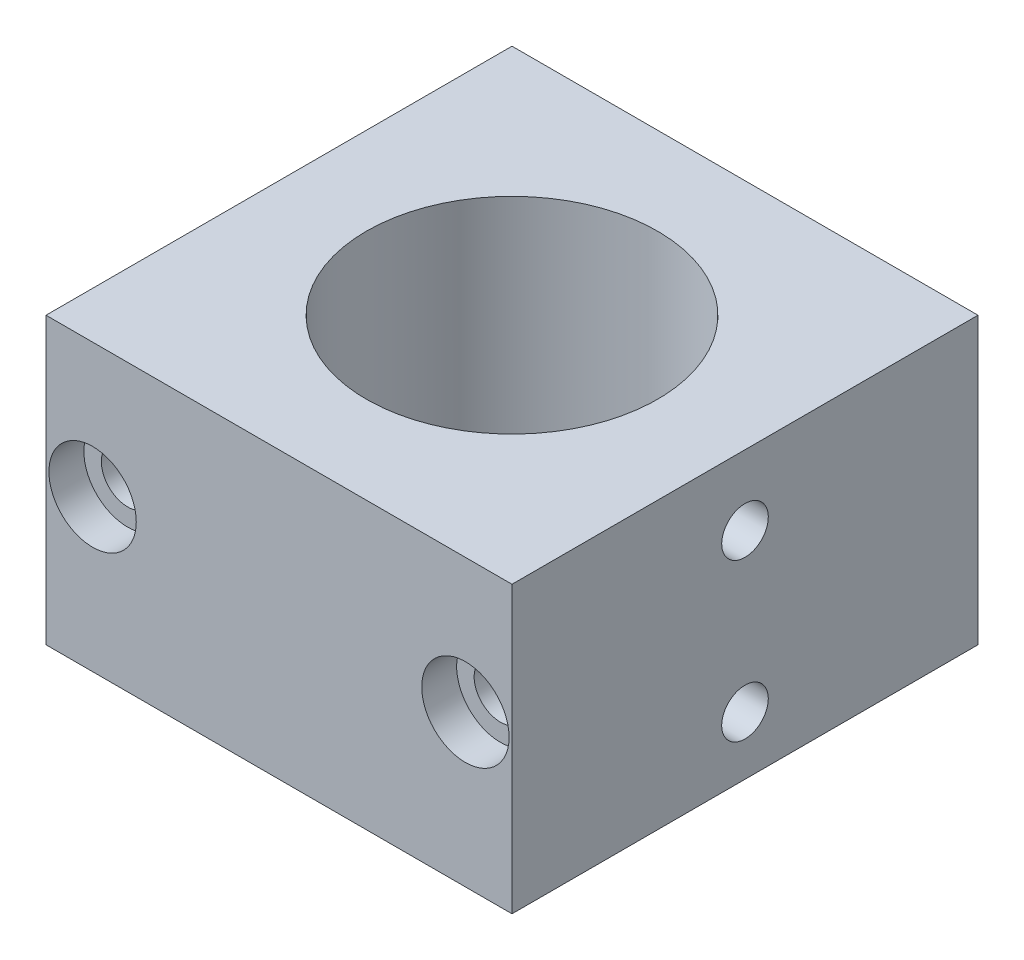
ISO-10303-21;
HEADER;
FILE_DESCRIPTION(('STEP AP214'),'2;1');
FILE_NAME('part.step','',(''),(''),'','','');
FILE_SCHEMA(('AUTOMOTIVE_DESIGN { 1 0 10303 214 1 1 1 1 }'));
ENDSEC;
DATA;
#1=APPLICATION_CONTEXT('core data for automotive mechanical design processes');
#2=APPLICATION_PROTOCOL_DEFINITION('international standard','automotive_design',2000,#1);
#3=PRODUCT_CONTEXT('',#1,'mechanical');
#4=PRODUCT('Part','Part','',(#3));
#5=PRODUCT_RELATED_PRODUCT_CATEGORY('part','',(#4));
#6=PRODUCT_DEFINITION_FORMATION('','',#4);
#7=PRODUCT_DEFINITION_CONTEXT('part definition',#1,'design');
#8=PRODUCT_DEFINITION('design','',#6,#7);
#9=PRODUCT_DEFINITION_SHAPE('','',#8);
#10=(LENGTH_UNIT() NAMED_UNIT(*) SI_UNIT(.MILLI.,.METRE.));
#11=(NAMED_UNIT(*) PLANE_ANGLE_UNIT() SI_UNIT($,.RADIAN.));
#12=(NAMED_UNIT(*) SI_UNIT($,.STERADIAN.) SOLID_ANGLE_UNIT());
#13=UNCERTAINTY_MEASURE_WITH_UNIT(LENGTH_MEASURE(1.E-05),#10,'distance_accuracy_value','');
#14=(GEOMETRIC_REPRESENTATION_CONTEXT(3) GLOBAL_UNCERTAINTY_ASSIGNED_CONTEXT((#13)) GLOBAL_UNIT_ASSIGNED_CONTEXT((#10,
#11,#12)) REPRESENTATION_CONTEXT('',''));
#15=CARTESIAN_POINT('',(0.,0.,0.));
#16=DIRECTION('',(0.,0.,1.));
#17=DIRECTION('',(1.,0.,0.));
#18=AXIS2_PLACEMENT_3D('',#15,#16,#17);
#19=CARTESIAN_POINT('',(20.,4.99999999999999,20.));
#20=DIRECTION('',(0.,1.,0.));
#21=DIRECTION('',(-1.,0.,0.));
#22=AXIS2_PLACEMENT_3D('',#19,#20,#21);
#23=CYLINDRICAL_SURFACE('',#22,12.5);
#24=CARTESIAN_POINT('',(32.4899959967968,4.99999999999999,20.5));
#25=CARTESIAN_POINT('',(32.4899923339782,5.02811655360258,20.500023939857));
#26=CARTESIAN_POINT('',(32.4900908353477,5.05622572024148,20.4976298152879));
#27=CARTESIAN_POINT('',(32.4904650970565,5.1116275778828,20.488182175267));
#28=CARTESIAN_POINT('',(32.4907407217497,5.13892087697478,20.481132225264));
#29=CARTESIAN_POINT('',(32.4914423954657,5.19194663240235,20.4625449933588));
#30=CARTESIAN_POINT('',(32.4918685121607,5.21767838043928,20.4510056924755));
#31=CARTESIAN_POINT('',(32.4928218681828,5.26683517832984,20.423778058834));
#32=CARTESIAN_POINT('',(32.49334908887,5.29026065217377,20.408090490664));
#33=CARTESIAN_POINT('',(32.4944459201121,5.33415860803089,20.3729988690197));
#34=CARTESIAN_POINT('',(32.4950155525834,5.35462954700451,20.3535928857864));
#35=CARTESIAN_POINT('',(32.496132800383,5.39202700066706,20.3116168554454));
#36=CARTESIAN_POINT('',(32.4966804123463,5.40895297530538,20.2890463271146));
#37=CARTESIAN_POINT('',(32.4976920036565,5.43878075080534,20.2413757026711));
#38=CARTESIAN_POINT('',(32.4981559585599,5.45168137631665,20.2162748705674));
#39=CARTESIAN_POINT('',(32.4989476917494,5.4730839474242,20.1642630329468));
#40=CARTESIAN_POINT('',(32.4992754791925,5.48158618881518,20.1373521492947));
#41=CARTESIAN_POINT('',(32.4997578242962,5.49394756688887,20.0824975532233));
#42=CARTESIAN_POINT('',(32.4999124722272,5.49780912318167,20.0545543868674));
#43=CARTESIAN_POINT('',(32.5000314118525,5.50078699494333,19.9984153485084));
#44=CARTESIAN_POINT('',(32.4999956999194,5.49990321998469,19.9702194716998));
#45=CARTESIAN_POINT('',(32.4997380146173,5.49341737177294,19.9143933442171));
#46=CARTESIAN_POINT('',(32.4995161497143,5.48781804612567,19.8867627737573));
#47=CARTESIAN_POINT('',(32.498911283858,5.47206431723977,19.8328342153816));
#48=CARTESIAN_POINT('',(32.4985282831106,5.46190991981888,19.8065362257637));
#49=CARTESIAN_POINT('',(32.4976441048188,5.43733089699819,19.7560098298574));
#50=CARTESIAN_POINT('',(32.4971428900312,5.42290492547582,19.7317820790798));
#51=CARTESIAN_POINT('',(32.4960787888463,5.39019401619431,19.6860924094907));
#52=CARTESIAN_POINT('',(32.4955159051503,5.37190924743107,19.6646303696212));
#53=CARTESIAN_POINT('',(32.4943914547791,5.33198695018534,19.6250667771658));
#54=CARTESIAN_POINT('',(32.4938298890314,5.3103475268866,19.6069671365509));
#55=CARTESIAN_POINT('',(32.4927715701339,5.26432844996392,19.5746518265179));
#56=CARTESIAN_POINT('',(32.492274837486,5.23994793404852,19.5604373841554));
#57=CARTESIAN_POINT('',(32.4914019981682,5.18913041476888,19.5362953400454));
#58=CARTESIAN_POINT('',(32.4910259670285,5.16269213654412,19.52637042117));
#59=CARTESIAN_POINT('',(32.4904386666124,5.10855544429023,19.5111199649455));
#60=CARTESIAN_POINT('',(32.4902271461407,5.08085902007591,19.5057874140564));
#61=CARTESIAN_POINT('',(32.4900332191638,5.03534351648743,19.500934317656));
#62=CARTESIAN_POINT('',(32.4899949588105,5.01766715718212,19.4999923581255));
#63=CARTESIAN_POINT('',(32.4899959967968,4.99999999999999,19.5));
#64=B_SPLINE_CURVE_WITH_KNOTS('',3,(#24,#25,#26,#27,#28,#29,#30,#31,#32,#33,#34,#35,#36,#37,#38,
#39,#40,#41,#42,#43,#44,#45,#46,#47,#48,#49,#50,#51,#52,#53,#54,#55,#56,#57,#58,#59,#60,#61,#62,
#63),.UNSPECIFIED.,.F.,.F.,(4,2,2,2,2,2,2,2,2,2,2,2,2,2,2,2,2,2,2,4),(0.,0.0842371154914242,
0.168409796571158,0.252620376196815,0.336815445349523,0.421054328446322,0.505306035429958,
0.589582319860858,0.673852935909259,0.758079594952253,0.842307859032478,0.926487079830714,
1.0106661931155,1.09487186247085,1.17907384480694,1.26332356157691,1.34759985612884,
1.43192878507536,1.51612869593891,1.56912952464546),.UNSPECIFIED.);
#65=CARTESIAN_POINT('',(32.4899959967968,4.99999999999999,20.5));
#66=VERTEX_POINT('',#65);
#67=CARTESIAN_POINT('',(32.4899959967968,4.99999999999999,19.5));
#68=VERTEX_POINT('',#67);
#69=EDGE_CURVE('E187',#66,#68,#64,.T.);
#70=ORIENTED_EDGE('',*,*,#69,.F.);
#71=CARTESIAN_POINT('',(20.,4.99999999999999,20.));
#72=DIRECTION('',(0.,1.,0.));
#73=DIRECTION('',(-1.,0.,0.));
#74=AXIS2_PLACEMENT_3D('',#71,#72,#73);
#75=CIRCLE('',#74,12.5);
#76=EDGE_CURVE('E155',#68,#66,#75,.T.);
#77=ORIENTED_EDGE('',*,*,#76,.F.);
#78=EDGE_LOOP('',(#70,#77));
#79=FACE_BOUND('',#78,.T.);
#80=CARTESIAN_POINT('',(20.,24.5,20.));
#81=DIRECTION('',(0.,1.,0.));
#82=DIRECTION('',(-1.,0.,0.));
#83=AXIS2_PLACEMENT_3D('',#80,#81,#82);
#84=CIRCLE('',#83,12.5);
#85=CARTESIAN_POINT('',(7.5,24.5,20.));
#86=VERTEX_POINT('',#85);
#87=EDGE_CURVE('E157',#86,#86,#84,.T.);
#88=ORIENTED_EDGE('',*,*,#87,.T.);
#89=EDGE_LOOP('',(#88));
#90=FACE_BOUND('',#89,.T.);
#91=CARTESIAN_POINT('',(32.4899959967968,17.,19.5));
#92=CARTESIAN_POINT('',(32.4899961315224,16.9719268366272,19.5000012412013));
#93=CARTESIAN_POINT('',(32.4900916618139,16.9438336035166,19.5023722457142));
#94=CARTESIAN_POINT('',(32.4904635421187,16.8884216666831,19.5117972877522));
#95=CARTESIAN_POINT('',(32.4907401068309,16.8611039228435,19.5188568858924));
#96=CARTESIAN_POINT('',(32.4914426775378,16.8080537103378,19.5374570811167));
#97=CARTESIAN_POINT('',(32.4918686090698,16.7823204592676,19.5489954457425));
#98=CARTESIAN_POINT('',(32.4928218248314,16.7331632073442,19.57622233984));
#99=CARTESIAN_POINT('',(32.4933490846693,16.7097386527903,19.5919098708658));
#100=CARTESIAN_POINT('',(32.4944459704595,16.6658402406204,19.6270022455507));
#101=CARTESIAN_POINT('',(32.4950156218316,16.6453681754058,19.6464093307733));
#102=CARTESIAN_POINT('',(32.4961328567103,16.6079710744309,19.6883856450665));
#103=CARTESIAN_POINT('',(32.4966804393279,16.5910461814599,19.7109550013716));
#104=CARTESIAN_POINT('',(32.4976919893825,16.56121971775,19.7586235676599));
#105=CARTESIAN_POINT('',(32.4981559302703,16.5483194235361,19.783723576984));
#106=CARTESIAN_POINT('',(32.4989476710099,16.5269165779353,19.8357352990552));
#107=CARTESIAN_POINT('',(32.4992754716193,16.5184140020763,19.8626470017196));
#108=CARTESIAN_POINT('',(32.4997578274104,16.5060523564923,19.9175027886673));
#109=CARTESIAN_POINT('',(32.4999124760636,16.5021907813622,19.9454463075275));
#110=CARTESIAN_POINT('',(32.5000314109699,16.4992130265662,20.0015853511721));
#111=CARTESIAN_POINT('',(32.4999956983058,16.5000968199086,20.0297808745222));
#112=CARTESIAN_POINT('',(32.4997380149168,16.5065826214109,20.0856065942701));
#113=CARTESIAN_POINT('',(32.4995161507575,16.5121819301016,20.1132371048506));
#114=CARTESIAN_POINT('',(32.4989112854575,16.5279356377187,20.1671656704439));
#115=CARTESIAN_POINT('',(32.4985282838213,16.5380900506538,20.1934637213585));
#116=CARTESIAN_POINT('',(32.4976441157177,16.562668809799,20.243989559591));
#117=CARTESIAN_POINT('',(32.4971429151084,16.5770943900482,20.2682167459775));
#118=CARTESIAN_POINT('',(32.4960788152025,16.6098050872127,20.3139065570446));
#119=CARTESIAN_POINT('',(32.4955159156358,16.6280902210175,20.3353691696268));
#120=CARTESIAN_POINT('',(32.494391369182,16.6680162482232,20.3749363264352));
#121=CARTESIAN_POINT('',(32.4938297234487,16.6896594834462,20.3930385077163));
#122=CARTESIAN_POINT('',(32.492771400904,16.7356790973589,20.4253527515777));
#123=CARTESIAN_POINT('',(32.4922747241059,16.7600554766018,20.4395648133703));
#124=CARTESIAN_POINT('',(32.4914023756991,16.810850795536,20.4636951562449));
#125=CARTESIAN_POINT('',(32.491026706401,16.8372697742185,20.4736133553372));
#126=CARTESIAN_POINT('',(32.490438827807,16.8913997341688,20.4888728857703));
#127=CARTESIAN_POINT('',(32.4902266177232,16.9191107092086,20.4942142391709));
#128=CARTESIAN_POINT('',(32.4899897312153,16.975017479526,20.5001655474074));
#129=CARTESIAN_POINT('',(32.4899649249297,17.0032129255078,20.5007787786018));
#130=CARTESIAN_POINT('',(32.490105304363,17.0593063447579,20.4972649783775));
#131=CARTESIAN_POINT('',(32.4902704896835,17.08720431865,20.493137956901));
#132=CARTESIAN_POINT('',(32.4907721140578,17.141901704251,20.4802635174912));
#133=CARTESIAN_POINT('',(32.4911084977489,17.1687014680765,20.4715175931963));
#134=CARTESIAN_POINT('',(32.4919145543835,17.2204525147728,20.4496551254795));
#135=CARTESIAN_POINT('',(32.4923842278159,17.2454037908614,20.4365385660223));
#136=CARTESIAN_POINT('',(32.4934042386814,17.2927646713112,20.4062987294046));
#137=CARTESIAN_POINT('',(32.4939546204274,17.3151728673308,20.3891732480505));
#138=CARTESIAN_POINT('',(32.4950738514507,17.3567973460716,20.3514049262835));
#139=CARTESIAN_POINT('',(32.4956427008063,17.3760136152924,20.3307620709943));
#140=CARTESIAN_POINT('',(32.4967351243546,17.4107197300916,20.2865309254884));
#141=CARTESIAN_POINT('',(32.4972586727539,17.4262074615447,20.2629409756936));
#142=CARTESIAN_POINT('',(32.4982011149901,17.4530024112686,20.2134936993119));
#143=CARTESIAN_POINT('',(32.4986200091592,17.4643096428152,20.1876363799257));
#144=CARTESIAN_POINT('',(32.4993058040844,17.4824189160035,20.1343962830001));
#145=CARTESIAN_POINT('',(32.4995727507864,17.4892223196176,20.1070139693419));
#146=CARTESIAN_POINT('',(32.4999247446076,17.498135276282,20.051494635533));
#147=CARTESIAN_POINT('',(32.5000097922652,17.5002448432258,20.0233576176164));
#148=CARTESIAN_POINT('',(32.4999884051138,17.4997100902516,19.9671486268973));
#149=CARTESIAN_POINT('',(32.4998821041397,17.4970690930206,19.939076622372));
#150=CARTESIAN_POINT('',(32.4994902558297,17.4871150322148,19.8837748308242));
#151=CARTESIAN_POINT('',(32.4992047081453,17.4798019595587,19.8565450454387));
#152=CARTESIAN_POINT('',(32.4984865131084,17.4607119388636,19.8036997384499));
#153=CARTESIAN_POINT('',(32.4980538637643,17.4489349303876,19.7780842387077));
#154=CARTESIAN_POINT('',(32.4970901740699,17.421252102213,19.7291942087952));
#155=CARTESIAN_POINT('',(32.496559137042,17.405346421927,19.7059195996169));
#156=CARTESIAN_POINT('',(32.4954580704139,17.3698465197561,19.66235585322));
#157=CARTESIAN_POINT('',(32.4948880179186,17.3502501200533,19.6420684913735));
#158=CARTESIAN_POINT('',(32.4937732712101,17.3079238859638,19.6050656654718));
#159=CARTESIAN_POINT('',(32.4932285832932,17.2851932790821,19.588351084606));
#160=CARTESIAN_POINT('',(32.4922257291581,17.2372310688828,19.558963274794));
#161=CARTESIAN_POINT('',(32.4917676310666,17.21199751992,19.5462932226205));
#162=CARTESIAN_POINT('',(32.4909907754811,17.1597787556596,19.525384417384));
#163=CARTESIAN_POINT('',(32.4906718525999,17.132795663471,19.5171404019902));
#164=CARTESIAN_POINT('',(32.4902942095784,17.0880361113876,19.5074926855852));
#165=CARTESIAN_POINT('',(32.4901828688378,17.0705499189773,19.504686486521));
#166=CARTESIAN_POINT('',(32.490033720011,17.0353784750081,19.5009397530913));
#167=CARTESIAN_POINT('',(32.4899959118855,17.0176932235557,19.4999992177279));
#168=CARTESIAN_POINT('',(32.4899959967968,17.,19.5));
#169=B_SPLINE_CURVE_WITH_KNOTS('',3,(#91,#92,#93,#94,#95,#96,#97,#98,#99,#100,#101,#102,#103,
#104,#105,#106,#107,#108,#109,#110,#111,#112,#113,#114,#115,#116,#117,#118,#119,#120,#121,#122,
#123,#124,#125,#126,#127,#128,#129,#130,#131,#132,#133,#134,#135,#136,#137,#138,#139,#140,#141,
#142,#143,#144,#145,#146,#147,#148,#149,#150,#151,#152,#153,#154,#155,#156,#157,#158,#159,#160,
#161,#162,#163,#164,#165,#166,#167,#168),.UNSPECIFIED.,.T.,.F.,(4,2,2,2,2,2,2,2,2,2,2,2,2,2,2,2,
2,2,2,2,2,2,2,2,2,2,2,2,2,2,2,2,2,2,2,2,2,2,4),(0.,0.0841549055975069,0.168409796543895,
0.252622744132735,0.336815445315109,0.421059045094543,0.505306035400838,0.589579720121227,
0.673852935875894,0.758080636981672,0.842307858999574,0.926486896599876,1.01066619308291,
1.09486983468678,1.17907384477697,1.26333684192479,1.34759985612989,1.43186447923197,
1.51612869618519,1.60033451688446,1.68454016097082,1.76871859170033,1.85289733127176,
1.93712246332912,2.02134795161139,2.10562108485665,2.18989395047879,2.27414132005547,
2.35838844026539,2.44257665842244,2.52676504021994,2.6109545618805,2.69514124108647,
2.77937775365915,2.86363506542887,2.94795839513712,3.03218124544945,3.08522023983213,
3.13825920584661),.UNSPECIFIED.);
#170=CARTESIAN_POINT('',(32.4899959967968,17.,19.5));
#171=VERTEX_POINT('',#170);
#172=EDGE_CURVE('E270',#171,#171,#169,.T.);
#173=ORIENTED_EDGE('',*,*,#172,.F.);
#174=EDGE_LOOP('',(#173));
#175=FACE_BOUND('',#174,.T.);
#176=ADVANCED_FACE('F37',(#79,#90,#175),#23,.F.);
#177=CARTESIAN_POINT('',(34.,18.5,20.));
#178=DIRECTION('',(1.,0.,0.));
#179=DIRECTION('',(0.,0.,-1.));
#180=AXIS2_PLACEMENT_3D('',#177,#178,#179);
#181=PLANE('',#180);
#182=CARTESIAN_POINT('',(34.,18.5,20.));
#183=DIRECTION('',(1.,0.,0.));
#184=DIRECTION('',(0.,0.,-1.));
#185=AXIS2_PLACEMENT_3D('',#182,#183,#184);
#186=CIRCLE('',#185,2.00000000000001);
#187=CARTESIAN_POINT('',(34.,16.5,20.));
#188=VERTEX_POINT('',#187);
#189=EDGE_CURVE('E272',#188,#188,#186,.T.);
#190=ORIENTED_EDGE('',*,*,#189,.T.);
#191=CARTESIAN_POINT('',(34.,17.,20.));
#192=DIRECTION('',(1.,0.,0.));
#193=DIRECTION('',(0.,0.,-1.));
#194=AXIS2_PLACEMENT_3D('',#191,#192,#193);
#195=CIRCLE('',#194,0.5);
#196=EDGE_CURVE('E41',#188,#188,#195,.F.);
#197=ORIENTED_EDGE('',*,*,#196,.T.);
#198=EDGE_LOOP('',(#190,#197));
#199=FACE_BOUND('',#198,.T.);
#200=ADVANCED_FACE('F254',(#199),#181,.T.);
#201=CARTESIAN_POINT('',(40.,24.5,40.));
#202=DIRECTION('',(1.,0.,0.));
#203=DIRECTION('',(0.,0.,-1.));
#204=AXIS2_PLACEMENT_3D('',#201,#202,#203);
#205=PLANE('',#204);
#206=CARTESIAN_POINT('',(40.,5.,20.));
#207=DIRECTION('',(1.,0.,0.));
#208=DIRECTION('',(0.,0.,-1.));
#209=AXIS2_PLACEMENT_3D('',#206,#207,#208);
#210=CIRCLE('',#209,2.00000000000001);
#211=CARTESIAN_POINT('',(40.,5.,18.));
#212=VERTEX_POINT('',#211);
#213=EDGE_CURVE('E180',#212,#212,#210,.T.);
#214=ORIENTED_EDGE('',*,*,#213,.F.);
#215=EDGE_LOOP('',(#214));
#216=FACE_BOUND('',#215,.T.);
#217=DIRECTION('',(0.,-1.,0.));
#218=VECTOR('',#217,1.);
#219=CARTESIAN_POINT('',(40.,24.5,0.));
#220=LINE('',#219,#218);
#221=CARTESIAN_POINT('',(40.,24.5,0.));
#222=VERTEX_POINT('',#221);
#223=CARTESIAN_POINT('',(40.,0.,0.));
#224=VERTEX_POINT('',#223);
#225=EDGE_CURVE('E146',#222,#224,#220,.T.);
#226=ORIENTED_EDGE('',*,*,#225,.F.);
#227=DIRECTION('',(0.,0.,-1.));
#228=VECTOR('',#227,1.);
#229=CARTESIAN_POINT('',(40.,24.5,40.));
#230=LINE('',#229,#228);
#231=CARTESIAN_POINT('',(40.,24.5,40.));
#232=VERTEX_POINT('',#231);
#233=EDGE_CURVE('E128',#232,#222,#230,.T.);
#234=ORIENTED_EDGE('',*,*,#233,.F.);
#235=DIRECTION('',(0.,-1.,0.));
#236=VECTOR('',#235,1.);
#237=CARTESIAN_POINT('',(40.,24.5,40.));
#238=LINE('',#237,#236);
#239=CARTESIAN_POINT('',(40.,0.,40.));
#240=VERTEX_POINT('',#239);
#241=EDGE_CURVE('E135',#232,#240,#238,.T.);
#242=ORIENTED_EDGE('',*,*,#241,.T.);
#243=DIRECTION('',(0.,0.,-1.));
#244=VECTOR('',#243,1.);
#245=CARTESIAN_POINT('',(40.,0.,40.));
#246=LINE('',#245,#244);
#247=EDGE_CURVE('E131',#240,#224,#246,.T.);
#248=ORIENTED_EDGE('',*,*,#247,.T.);
#249=EDGE_LOOP('',(#226,#234,#242,#248));
#250=FACE_BOUND('',#249,.T.);
#251=CARTESIAN_POINT('',(40.,18.5,20.));
#252=DIRECTION('',(1.,0.,0.));
#253=DIRECTION('',(0.,0.,-1.));
#254=AXIS2_PLACEMENT_3D('',#251,#252,#253);
#255=CIRCLE('',#254,2.00000000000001);
#256=CARTESIAN_POINT('',(40.,16.5,20.));
#257=VERTEX_POINT('',#256);
#258=EDGE_CURVE('E275',#257,#257,#255,.T.);
#259=ORIENTED_EDGE('',*,*,#258,.F.);
#260=EDGE_LOOP('',(#259));
#261=FACE_BOUND('',#260,.T.);
#262=ADVANCED_FACE('F250',(#216,#250,#261),#205,.T.);
#263=CARTESIAN_POINT('',(20.,4.99999999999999,20.));
#264=DIRECTION('',(0.,1.,0.));
#265=DIRECTION('',(-1.,0.,0.));
#266=AXIS2_PLACEMENT_3D('',#263,#264,#265);
#267=PLANE('',#266);
#268=ORIENTED_EDGE('',*,*,#76,.T.);
#269=DIRECTION('',(1.,0.,0.));
#270=VECTOR('',#269,1.);
#271=CARTESIAN_POINT('',(40.,5.,20.5));
#272=LINE('',#271,#270);
#273=CARTESIAN_POINT('',(31.,5.,20.5));
#274=VERTEX_POINT('',#273);
#275=EDGE_CURVE('E110',#66,#274,#272,.F.);
#276=ORIENTED_EDGE('',*,*,#275,.T.);
#277=DIRECTION('',(0.515038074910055,0.,0.857167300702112));
#278=VECTOR('',#277,1.);
#279=CARTESIAN_POINT('',(30.6995696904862,5.,20.));
#280=LINE('',#279,#278);
#281=CARTESIAN_POINT('',(30.6995696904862,5.,20.));
#282=VERTEX_POINT('',#281);
#283=EDGE_CURVE('E100',#274,#282,#280,.F.);
#284=ORIENTED_EDGE('',*,*,#283,.T.);
#285=DIRECTION('',(-0.515038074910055,0.,0.857167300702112));
#286=VECTOR('',#285,1.);
#287=CARTESIAN_POINT('',(30.6995696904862,5.,20.));
#288=LINE('',#287,#286);
#289=CARTESIAN_POINT('',(31.,5.,19.5));
#290=VERTEX_POINT('',#289);
#291=EDGE_CURVE('E97',#282,#290,#288,.F.);
#292=ORIENTED_EDGE('',*,*,#291,.T.);
#293=DIRECTION('',(1.,0.,0.));
#294=VECTOR('',#293,1.);
#295=CARTESIAN_POINT('',(40.,5.,19.5));
#296=LINE('',#295,#294);
#297=EDGE_CURVE('E115',#290,#68,#296,.T.);
#298=ORIENTED_EDGE('',*,*,#297,.T.);
#299=EDGE_LOOP('',(#268,#276,#284,#292,#298));
#300=FACE_BOUND('',#299,.T.);
#301=ADVANCED_FACE('F109',(#300),#267,.T.);
#302=CARTESIAN_POINT('',(34.,5.00000000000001,20.));
#303=DIRECTION('',(1.,0.,0.));
#304=DIRECTION('',(0.,0.,-1.));
#305=AXIS2_PLACEMENT_3D('',#302,#303,#304);
#306=PLANE('',#305);
#307=CARTESIAN_POINT('',(34.,5.,20.));
#308=DIRECTION('',(1.,0.,0.));
#309=DIRECTION('',(0.,0.,-1.));
#310=AXIS2_PLACEMENT_3D('',#307,#308,#309);
#311=CIRCLE('',#310,2.00000000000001);
#312=CARTESIAN_POINT('',(34.,5.,18.));
#313=VERTEX_POINT('',#312);
#314=EDGE_CURVE('E183',#313,#313,#311,.T.);
#315=ORIENTED_EDGE('',*,*,#314,.T.);
#316=EDGE_LOOP('',(#315));
#317=FACE_BOUND('',#316,.T.);
#318=CARTESIAN_POINT('',(34.,5.,20.));
#319=DIRECTION('',(1.,0.,0.));
#320=DIRECTION('',(0.,0.,-1.));
#321=AXIS2_PLACEMENT_3D('',#318,#319,#320);
#322=CIRCLE('',#321,0.5);
#323=CARTESIAN_POINT('',(34.,5.,19.5));
#324=VERTEX_POINT('',#323);
#325=EDGE_CURVE('E112',#324,#324,#322,.F.);
#326=ORIENTED_EDGE('',*,*,#325,.T.);
#327=EDGE_LOOP('',(#326));
#328=FACE_BOUND('',#327,.T.);
#329=ADVANCED_FACE('F209',(#317,#328),#306,.T.);
#330=CARTESIAN_POINT('',(0.,0.,40.));
#331=DIRECTION('',(0.,0.,-1.));
#332=DIRECTION('',(-1.,0.,0.));
#333=AXIS2_PLACEMENT_3D('',#330,#331,#332);
#334=PLANE('',#333);
#335=CARTESIAN_POINT('',(4.,13.,40.));
#336=DIRECTION('',(0.,0.,1.));
#337=DIRECTION('',(1.,0.,0.));
#338=AXIS2_PLACEMENT_3D('',#335,#336,#337);
#339=CIRCLE('',#338,3.75000000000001);
#340=CARTESIAN_POINT('',(7.75000000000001,13.,40.));
#341=VERTEX_POINT('',#340);
#342=EDGE_CURVE('E119',#341,#341,#339,.T.);
#343=ORIENTED_EDGE('',*,*,#342,.F.);
#344=EDGE_LOOP('',(#343));
#345=FACE_BOUND('',#344,.T.);
#346=DIRECTION('',(0.,1.,0.));
#347=VECTOR('',#346,1.);
#348=CARTESIAN_POINT('',(0.,0.,40.));
#349=LINE('',#348,#347);
#350=CARTESIAN_POINT('',(0.,0.,40.));
#351=VERTEX_POINT('',#350);
#352=CARTESIAN_POINT('',(0.,24.5,40.));
#353=VERTEX_POINT('',#352);
#354=EDGE_CURVE('E140',#351,#353,#349,.T.);
#355=ORIENTED_EDGE('',*,*,#354,.F.);
#356=DIRECTION('',(1.,0.,0.));
#357=VECTOR('',#356,1.);
#358=CARTESIAN_POINT('',(0.,0.,40.));
#359=LINE('',#358,#357);
#360=EDGE_CURVE('E129',#351,#240,#359,.T.);
#361=ORIENTED_EDGE('',*,*,#360,.T.);
#362=ORIENTED_EDGE('',*,*,#241,.F.);
#363=DIRECTION('',(-1.,0.,0.));
#364=VECTOR('',#363,1.);
#365=CARTESIAN_POINT('',(40.,24.5,40.));
#366=LINE('',#365,#364);
#367=EDGE_CURVE('E138',#232,#353,#366,.T.);
#368=ORIENTED_EDGE('',*,*,#367,.T.);
#369=EDGE_LOOP('',(#355,#361,#362,#368));
#370=FACE_BOUND('',#369,.T.);
#371=CARTESIAN_POINT('',(36.,13.,40.));
#372=DIRECTION('',(0.,0.,1.));
#373=DIRECTION('',(1.,0.,0.));
#374=AXIS2_PLACEMENT_3D('',#371,#372,#373);
#375=CIRCLE('',#374,3.75000000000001);
#376=CARTESIAN_POINT('',(39.75,13.,40.));
#377=VERTEX_POINT('',#376);
#378=EDGE_CURVE('E177',#377,#377,#375,.T.);
#379=ORIENTED_EDGE('',*,*,#378,.F.);
#380=EDGE_LOOP('',(#379));
#381=FACE_BOUND('',#380,.T.);
#382=ADVANCED_FACE('F212',(#345,#370,#381),#334,.F.);
#383=CARTESIAN_POINT('',(0.,0.,0.));
#384=DIRECTION('',(0.,0.,-1.));
#385=DIRECTION('',(-1.,0.,0.));
#386=AXIS2_PLACEMENT_3D('',#383,#384,#385);
#387=PLANE('',#386);
#388=CARTESIAN_POINT('',(4.,13.,0.));
#389=DIRECTION('',(0.,0.,-1.));
#390=DIRECTION('',(-1.,0.,0.));
#391=AXIS2_PLACEMENT_3D('',#388,#389,#390);
#392=CIRCLE('',#391,2.25000000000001);
#393=CARTESIAN_POINT('',(1.74999999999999,13.,0.));
#394=VERTEX_POINT('',#393);
#395=EDGE_CURVE('E121',#394,#394,#392,.F.);
#396=ORIENTED_EDGE('',*,*,#395,.T.);
#397=EDGE_LOOP('',(#396));
#398=FACE_BOUND('',#397,.T.);
#399=DIRECTION('',(0.,1.,0.));
#400=VECTOR('',#399,1.);
#401=CARTESIAN_POINT('',(0.,0.,0.));
#402=LINE('',#401,#400);
#403=CARTESIAN_POINT('',(0.,0.,0.));
#404=VERTEX_POINT('',#403);
#405=CARTESIAN_POINT('',(0.,24.5,0.));
#406=VERTEX_POINT('',#405);
#407=EDGE_CURVE('E152',#404,#406,#402,.T.);
#408=ORIENTED_EDGE('',*,*,#407,.T.);
#409=DIRECTION('',(-1.,0.,0.));
#410=VECTOR('',#409,1.);
#411=CARTESIAN_POINT('',(40.,24.5,0.));
#412=LINE('',#411,#410);
#413=EDGE_CURVE('E149',#222,#406,#412,.T.);
#414=ORIENTED_EDGE('',*,*,#413,.F.);
#415=ORIENTED_EDGE('',*,*,#225,.T.);
#416=DIRECTION('',(1.,0.,0.));
#417=VECTOR('',#416,1.);
#418=CARTESIAN_POINT('',(0.,0.,0.));
#419=LINE('',#418,#417);
#420=EDGE_CURVE('E143',#404,#224,#419,.T.);
#421=ORIENTED_EDGE('',*,*,#420,.F.);
#422=EDGE_LOOP('',(#408,#414,#415,#421));
#423=FACE_BOUND('',#422,.T.);
#424=CARTESIAN_POINT('',(36.,13.,0.));
#425=DIRECTION('',(0.,0.,-1.));
#426=DIRECTION('',(-1.,0.,0.));
#427=AXIS2_PLACEMENT_3D('',#424,#425,#426);
#428=CIRCLE('',#427,2.25000000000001);
#429=CARTESIAN_POINT('',(33.75,13.,0.));
#430=VERTEX_POINT('',#429);
#431=EDGE_CURVE('E116',#430,#430,#428,.F.);
#432=ORIENTED_EDGE('',*,*,#431,.T.);
#433=EDGE_LOOP('',(#432));
#434=FACE_BOUND('',#433,.T.);
#435=ADVANCED_FACE('F356',(#398,#423,#434),#387,.T.);
#436=CARTESIAN_POINT('',(0.,0.,40.));
#437=DIRECTION('',(-1.,0.,0.));
#438=DIRECTION('',(0.,0.,1.));
#439=AXIS2_PLACEMENT_3D('',#436,#437,#438);
#440=PLANE('',#439);
#441=ORIENTED_EDGE('',*,*,#407,.F.);
#442=DIRECTION('',(0.,0.,-1.));
#443=VECTOR('',#442,1.);
#444=CARTESIAN_POINT('',(0.,0.,40.));
#445=LINE('',#444,#443);
#446=EDGE_CURVE('E105',#351,#404,#445,.T.);
#447=ORIENTED_EDGE('',*,*,#446,.F.);
#448=ORIENTED_EDGE('',*,*,#354,.T.);
#449=DIRECTION('',(0.,0.,-1.));
#450=VECTOR('',#449,1.);
#451=CARTESIAN_POINT('',(0.,24.5,40.));
#452=LINE('',#451,#450);
#453=EDGE_CURVE('E126',#353,#406,#452,.T.);
#454=ORIENTED_EDGE('',*,*,#453,.T.);
#455=EDGE_LOOP('',(#441,#447,#448,#454));
#456=FACE_BOUND('',#455,.T.);
#457=ADVANCED_FACE('F39',(#456),#440,.T.);
#458=CARTESIAN_POINT('',(0.,0.,40.));
#459=DIRECTION('',(0.,1.,0.));
#460=DIRECTION('',(0.,0.,1.));
#461=AXIS2_PLACEMENT_3D('',#458,#459,#460);
#462=PLANE('',#461);
#463=CARTESIAN_POINT('',(20.,0.,20.));
#464=DIRECTION('',(0.,-1.,0.));
#465=DIRECTION('',(0.,0.,-1.));
#466=AXIS2_PLACEMENT_3D('',#463,#464,#465);
#467=CIRCLE('',#466,10.);
#468=CARTESIAN_POINT('',(20.,0.,9.99999999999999));
#469=VERTEX_POINT('',#468);
#470=EDGE_CURVE('E124',#469,#469,#467,.T.);
#471=ORIENTED_EDGE('',*,*,#470,.F.);
#472=EDGE_LOOP('',(#471));
#473=FACE_BOUND('',#472,.T.);
#474=ORIENTED_EDGE('',*,*,#420,.T.);
#475=ORIENTED_EDGE('',*,*,#247,.F.);
#476=ORIENTED_EDGE('',*,*,#360,.F.);
#477=ORIENTED_EDGE('',*,*,#446,.T.);
#478=EDGE_LOOP('',(#474,#475,#476,#477));
#479=FACE_BOUND('',#478,.T.);
#480=ADVANCED_FACE('F342',(#473,#479),#462,.F.);
#481=CARTESIAN_POINT('',(40.,24.5,40.));
#482=DIRECTION('',(0.,-1.,0.));
#483=DIRECTION('',(1.,0.,0.));
#484=AXIS2_PLACEMENT_3D('',#481,#482,#483);
#485=PLANE('',#484);
#486=ORIENTED_EDGE('',*,*,#87,.F.);
#487=EDGE_LOOP('',(#486));
#488=FACE_BOUND('',#487,.T.);
#489=ORIENTED_EDGE('',*,*,#413,.T.);
#490=ORIENTED_EDGE('',*,*,#453,.F.);
#491=ORIENTED_EDGE('',*,*,#367,.F.);
#492=ORIENTED_EDGE('',*,*,#233,.T.);
#493=EDGE_LOOP('',(#489,#490,#491,#492));
#494=FACE_BOUND('',#493,.T.);
#495=ADVANCED_FACE('F247',(#488,#494),#485,.F.);
#496=CARTESIAN_POINT('',(20.,2.,20.));
#497=DIRECTION('',(0.,-1.,0.));
#498=DIRECTION('',(0.,0.,-1.));
#499=AXIS2_PLACEMENT_3D('',#496,#497,#498);
#500=CYLINDRICAL_SURFACE('',#499,10.);
#501=CARTESIAN_POINT('',(20.,2.,20.));
#502=DIRECTION('',(0.,-1.,0.));
#503=DIRECTION('',(0.,0.,-1.));
#504=AXIS2_PLACEMENT_3D('',#501,#502,#503);
#505=CIRCLE('',#504,10.);
#506=CARTESIAN_POINT('',(20.,2.,9.99999999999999));
#507=VERTEX_POINT('',#506);
#508=EDGE_CURVE('E160',#507,#507,#505,.T.);
#509=ORIENTED_EDGE('',*,*,#508,.F.);
#510=EDGE_LOOP('',(#509));
#511=FACE_BOUND('',#510,.T.);
#512=ORIENTED_EDGE('',*,*,#470,.T.);
#513=EDGE_LOOP('',(#512));
#514=FACE_BOUND('',#513,.T.);
#515=ADVANCED_FACE('F244',(#511,#514),#500,.F.);
#516=CARTESIAN_POINT('',(20.,2.,20.));
#517=DIRECTION('',(0.,-1.,0.));
#518=DIRECTION('',(0.,0.,-1.));
#519=AXIS2_PLACEMENT_3D('',#516,#517,#518);
#520=PLANE('',#519);
#521=ORIENTED_EDGE('',*,*,#508,.T.);
#522=EDGE_LOOP('',(#521));
#523=FACE_BOUND('',#522,.T.);
#524=ADVANCED_FACE('F240',(#523),#520,.T.);
#525=CARTESIAN_POINT('',(4.,13.,40.));
#526=DIRECTION('',(0.,0.,1.));
#527=DIRECTION('',(1.,0.,0.));
#528=AXIS2_PLACEMENT_3D('',#525,#526,#527);
#529=CYLINDRICAL_SURFACE('',#528,2.25000000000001);
#530=ORIENTED_EDGE('',*,*,#395,.F.);
#531=EDGE_LOOP('',(#530));
#532=FACE_BOUND('',#531,.T.);
#533=CARTESIAN_POINT('',(4.,13.,37.));
#534=DIRECTION('',(0.,0.,1.));
#535=DIRECTION('',(1.,0.,0.));
#536=AXIS2_PLACEMENT_3D('',#533,#534,#535);
#537=CIRCLE('',#536,2.25000000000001);
#538=CARTESIAN_POINT('',(6.25000000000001,13.,37.));
#539=VERTEX_POINT('',#538);
#540=EDGE_CURVE('E125',#539,#539,#537,.T.);
#541=ORIENTED_EDGE('',*,*,#540,.T.);
#542=EDGE_LOOP('',(#541));
#543=FACE_BOUND('',#542,.T.);
#544=ADVANCED_FACE('F236',(#532,#543),#529,.F.);
#545=CARTESIAN_POINT('',(6.25000000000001,13.,37.));
#546=DIRECTION('',(0.,0.,1.));
#547=DIRECTION('',(1.,0.,0.));
#548=AXIS2_PLACEMENT_3D('',#545,#546,#547);
#549=PLANE('',#548);
#550=CARTESIAN_POINT('',(4.,13.,37.));
#551=DIRECTION('',(0.,0.,1.));
#552=DIRECTION('',(1.,0.,0.));
#553=AXIS2_PLACEMENT_3D('',#550,#551,#552);
#554=CIRCLE('',#553,3.75000000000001);
#555=CARTESIAN_POINT('',(7.75000000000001,13.,37.));
#556=VERTEX_POINT('',#555);
#557=EDGE_CURVE('E167',#556,#556,#554,.T.);
#558=ORIENTED_EDGE('',*,*,#557,.T.);
#559=EDGE_LOOP('',(#558));
#560=FACE_BOUND('',#559,.T.);
#561=ORIENTED_EDGE('',*,*,#540,.F.);
#562=EDGE_LOOP('',(#561));
#563=FACE_BOUND('',#562,.T.);
#564=ADVANCED_FACE('F232',(#560,#563),#549,.T.);
#565=CARTESIAN_POINT('',(4.,13.,40.));
#566=DIRECTION('',(0.,0.,1.));
#567=DIRECTION('',(1.,0.,0.));
#568=AXIS2_PLACEMENT_3D('',#565,#566,#567);
#569=CYLINDRICAL_SURFACE('',#568,3.75000000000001);
#570=ORIENTED_EDGE('',*,*,#342,.T.);
#571=EDGE_LOOP('',(#570));
#572=FACE_BOUND('',#571,.T.);
#573=ORIENTED_EDGE('',*,*,#557,.F.);
#574=EDGE_LOOP('',(#573));
#575=FACE_BOUND('',#574,.T.);
#576=ADVANCED_FACE('F228',(#572,#575),#569,.F.);
#577=CARTESIAN_POINT('',(36.,13.,40.));
#578=DIRECTION('',(0.,0.,1.));
#579=DIRECTION('',(1.,0.,0.));
#580=AXIS2_PLACEMENT_3D('',#577,#578,#579);
#581=CYLINDRICAL_SURFACE('',#580,2.25000000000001);
#582=ORIENTED_EDGE('',*,*,#431,.F.);
#583=EDGE_LOOP('',(#582));
#584=FACE_BOUND('',#583,.T.);
#585=CARTESIAN_POINT('',(36.,13.,37.));
#586=DIRECTION('',(0.,0.,1.));
#587=DIRECTION('',(1.,0.,0.));
#588=AXIS2_PLACEMENT_3D('',#585,#586,#587);
#589=CIRCLE('',#588,2.25000000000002);
#590=CARTESIAN_POINT('',(38.25,13.,37.));
#591=VERTEX_POINT('',#590);
#592=EDGE_CURVE('E120',#591,#591,#589,.T.);
#593=ORIENTED_EDGE('',*,*,#592,.T.);
#594=EDGE_LOOP('',(#593));
#595=FACE_BOUND('',#594,.T.);
#596=ADVANCED_FACE('F224',(#584,#595),#581,.F.);
#597=CARTESIAN_POINT('',(38.25,13.,37.));
#598=DIRECTION('',(0.,0.,1.));
#599=DIRECTION('',(1.,0.,0.));
#600=AXIS2_PLACEMENT_3D('',#597,#598,#599);
#601=PLANE('',#600);
#602=CARTESIAN_POINT('',(36.,13.,37.));
#603=DIRECTION('',(0.,0.,1.));
#604=DIRECTION('',(1.,0.,0.));
#605=AXIS2_PLACEMENT_3D('',#602,#603,#604);
#606=CIRCLE('',#605,3.75000000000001);
#607=CARTESIAN_POINT('',(39.75,13.,37.));
#608=VERTEX_POINT('',#607);
#609=EDGE_CURVE('E174',#608,#608,#606,.T.);
#610=ORIENTED_EDGE('',*,*,#609,.T.);
#611=EDGE_LOOP('',(#610));
#612=FACE_BOUND('',#611,.T.);
#613=ORIENTED_EDGE('',*,*,#592,.F.);
#614=EDGE_LOOP('',(#613));
#615=FACE_BOUND('',#614,.T.);
#616=ADVANCED_FACE('F220',(#612,#615),#601,.T.);
#617=CARTESIAN_POINT('',(36.,13.,40.));
#618=DIRECTION('',(0.,0.,1.));
#619=DIRECTION('',(1.,0.,0.));
#620=AXIS2_PLACEMENT_3D('',#617,#618,#619);
#621=CYLINDRICAL_SURFACE('',#620,3.75000000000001);
#622=ORIENTED_EDGE('',*,*,#378,.T.);
#623=EDGE_LOOP('',(#622));
#624=FACE_BOUND('',#623,.T.);
#625=ORIENTED_EDGE('',*,*,#609,.F.);
#626=EDGE_LOOP('',(#625));
#627=FACE_BOUND('',#626,.T.);
#628=ADVANCED_FACE('F216',(#624,#627),#621,.F.);
#629=CARTESIAN_POINT('',(40.,5.,20.));
#630=DIRECTION('',(1.,0.,0.));
#631=DIRECTION('',(0.,0.,-1.));
#632=AXIS2_PLACEMENT_3D('',#629,#630,#631);
#633=CYLINDRICAL_SURFACE('',#632,2.00000000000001);
#634=ORIENTED_EDGE('',*,*,#213,.T.);
#635=EDGE_LOOP('',(#634));
#636=FACE_BOUND('',#635,.T.);
#637=ORIENTED_EDGE('',*,*,#314,.F.);
#638=EDGE_LOOP('',(#637));
#639=FACE_BOUND('',#638,.T.);
#640=ADVANCED_FACE('F208',(#636,#639),#633,.F.);
#641=CARTESIAN_POINT('',(30.6995696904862,5.,20.));
#642=DIRECTION('',(1.,0.,0.));
#643=DIRECTION('',(0.,0.,-1.));
#644=AXIS2_PLACEMENT_3D('',#641,#642,#643);
#645=CONICAL_SURFACE('',#644,0.,1.02974425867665);
#646=CARTESIAN_POINT('',(31.,5.,20.));
#647=DIRECTION('',(1.,0.,0.));
#648=DIRECTION('',(0.,0.,-1.));
#649=AXIS2_PLACEMENT_3D('',#646,#647,#648);
#650=CIRCLE('',#649,0.499999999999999);
#651=EDGE_CURVE('E102',#274,#290,#650,.T.);
#652=ORIENTED_EDGE('',*,*,#651,.T.);
#653=ORIENTED_EDGE('',*,*,#291,.F.);
#654=ORIENTED_EDGE('',*,*,#283,.F.);
#655=EDGE_LOOP('',(#652,#653,#654));
#656=FACE_BOUND('',#655,.T.);
#657=ADVANCED_FACE('F99',(#656),#645,.F.);
#658=CARTESIAN_POINT('',(40.,5.,20.));
#659=DIRECTION('',(1.,0.,0.));
#660=DIRECTION('',(0.,0.,-1.));
#661=AXIS2_PLACEMENT_3D('',#658,#659,#660);
#662=CYLINDRICAL_SURFACE('',#661,0.5);
#663=ORIENTED_EDGE('',*,*,#325,.F.);
#664=EDGE_LOOP('',(#663));
#665=FACE_BOUND('',#664,.T.);
#666=ORIENTED_EDGE('',*,*,#69,.T.);
#667=ORIENTED_EDGE('',*,*,#297,.F.);
#668=ORIENTED_EDGE('',*,*,#651,.F.);
#669=ORIENTED_EDGE('',*,*,#275,.F.);
#670=EDGE_LOOP('',(#666,#667,#668,#669));
#671=FACE_BOUND('',#670,.T.);
#672=ADVANCED_FACE('F198',(#665,#671),#662,.F.);
#673=CARTESIAN_POINT('',(40.,18.5,20.));
#674=DIRECTION('',(1.,0.,0.));
#675=DIRECTION('',(0.,0.,-1.));
#676=AXIS2_PLACEMENT_3D('',#673,#674,#675);
#677=CYLINDRICAL_SURFACE('',#676,2.00000000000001);
#678=ORIENTED_EDGE('',*,*,#189,.F.);
#679=DIRECTION('',(1.,0.,0.));
#680=VECTOR('',#679,1.);
#681=CARTESIAN_POINT('',(35.5,16.5,20.));
#682=LINE('',#681,#680);
#683=EDGE_CURVE('E11',#188,#257,#682,.T.);
#684=ORIENTED_EDGE('',*,*,#683,.T.);
#685=ORIENTED_EDGE('',*,*,#258,.T.);
#686=ORIENTED_EDGE('',*,*,#683,.F.);
#687=EDGE_LOOP('',(#678,#684,#685,#686));
#688=FACE_BOUND('',#687,.T.);
#689=ADVANCED_FACE('F203',(#688),#677,.F.);
#690=CARTESIAN_POINT('',(40.,17.,20.));
#691=DIRECTION('',(1.,0.,0.));
#692=DIRECTION('',(0.,0.,-1.));
#693=AXIS2_PLACEMENT_3D('',#690,#691,#692);
#694=CYLINDRICAL_SURFACE('',#693,0.5);
#695=ORIENTED_EDGE('',*,*,#196,.F.);
#696=EDGE_LOOP('',(#695));
#697=FACE_BOUND('',#696,.T.);
#698=ORIENTED_EDGE('',*,*,#172,.T.);
#699=EDGE_LOOP('',(#698));
#700=FACE_BOUND('',#699,.T.);
#701=ADVANCED_FACE('F281',(#697,#700),#694,.F.);
#702=CLOSED_SHELL('',(#176,#200,#262,#301,#329,#382,#435,#457,#480,#495,#515,#524,#544,#564,
#576,#596,#616,#628,#640,#657,#672,#689,#701));
#703=MANIFOLD_SOLID_BREP('B2',#702);
#704=ADVANCED_BREP_SHAPE_REPRESENTATION('',(#18,#703),#14);
#705=SHAPE_DEFINITION_REPRESENTATION(#9,#704);
ENDSEC;
END-ISO-10303-21;
